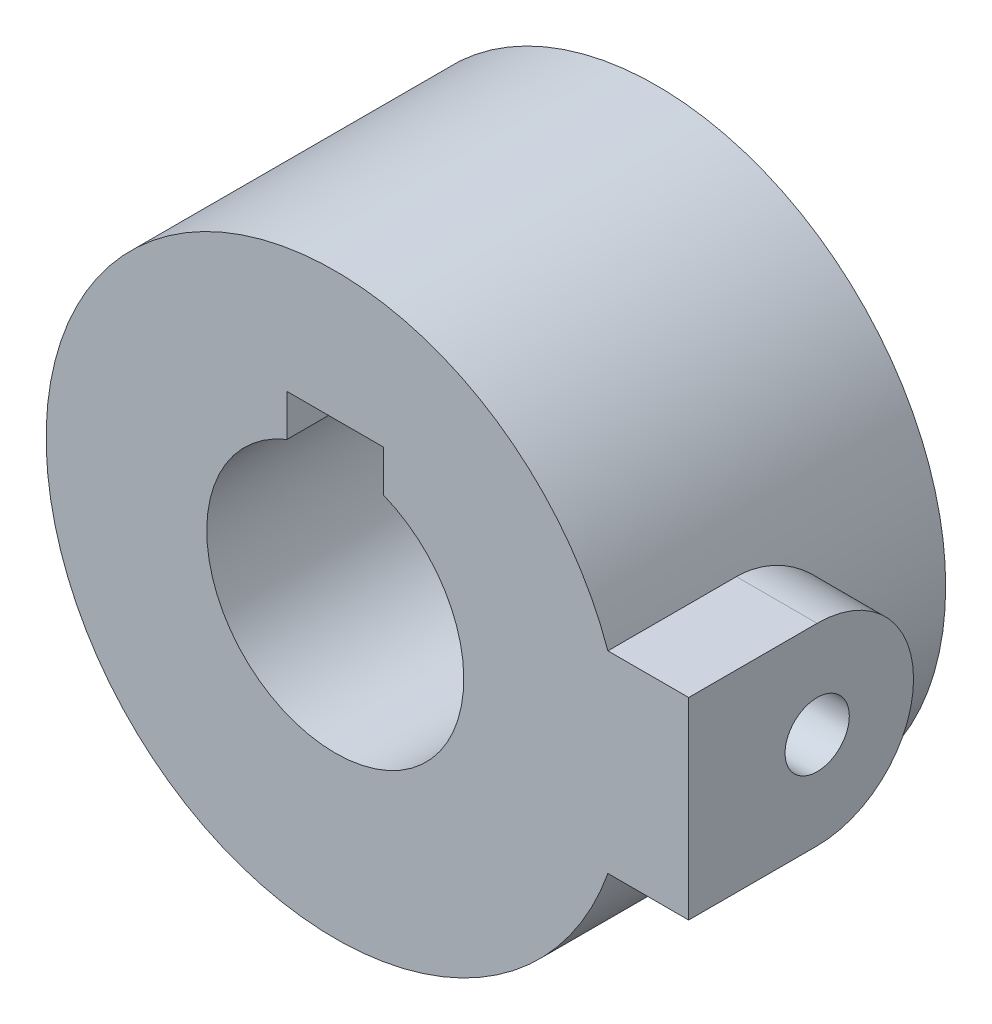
ISO-10303-21;
HEADER;
FILE_DESCRIPTION(('STEP AP214'),'2;1');
FILE_NAME('part.step','',(''),(''),'','','');
FILE_SCHEMA(('AUTOMOTIVE_DESIGN { 1 0 10303 214 1 1 1 1 }'));
ENDSEC;
DATA;
#1=APPLICATION_CONTEXT('core data for automotive mechanical design processes');
#2=APPLICATION_PROTOCOL_DEFINITION('international standard','automotive_design',2000,#1);
#3=PRODUCT_CONTEXT('',#1,'mechanical');
#4=PRODUCT('Part','Part','',(#3));
#5=PRODUCT_RELATED_PRODUCT_CATEGORY('part','',(#4));
#6=PRODUCT_DEFINITION_FORMATION('','',#4);
#7=PRODUCT_DEFINITION_CONTEXT('part definition',#1,'design');
#8=PRODUCT_DEFINITION('design','',#6,#7);
#9=PRODUCT_DEFINITION_SHAPE('','',#8);
#10=(LENGTH_UNIT() NAMED_UNIT(*) SI_UNIT(.MILLI.,.METRE.));
#11=(NAMED_UNIT(*) PLANE_ANGLE_UNIT() SI_UNIT($,.RADIAN.));
#12=(NAMED_UNIT(*) SI_UNIT($,.STERADIAN.) SOLID_ANGLE_UNIT());
#13=UNCERTAINTY_MEASURE_WITH_UNIT(LENGTH_MEASURE(1.E-05),#10,'distance_accuracy_value','');
#14=(GEOMETRIC_REPRESENTATION_CONTEXT(3) GLOBAL_UNCERTAINTY_ASSIGNED_CONTEXT((#13)) GLOBAL_UNIT_ASSIGNED_CONTEXT((#10,
#11,#12)) REPRESENTATION_CONTEXT('',''));
#15=CARTESIAN_POINT('',(0.,0.,0.));
#16=DIRECTION('',(0.,0.,1.));
#17=DIRECTION('',(1.,0.,0.));
#18=AXIS2_PLACEMENT_3D('',#15,#16,#17);
#19=CARTESIAN_POINT('',(0.,0.,20.));
#20=DIRECTION('',(0.,0.,1.));
#21=DIRECTION('',(1.,0.,0.));
#22=AXIS2_PLACEMENT_3D('',#19,#20,#21);
#23=PLANE('',#22);
#24=CARTESIAN_POINT('',(0.,0.,20.));
#25=DIRECTION('',(0.,0.,1.));
#26=DIRECTION('',(1.,0.,0.));
#27=AXIS2_PLACEMENT_3D('',#24,#25,#26);
#28=CIRCLE('',#27,18.);
#29=CARTESIAN_POINT('',(16.9705627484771,6.,20.));
#30=VERTEX_POINT('',#29);
#31=CARTESIAN_POINT('',(16.9705627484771,-6.,20.));
#32=VERTEX_POINT('',#31);
#33=EDGE_CURVE('E58',#30,#32,#28,.T.);
#34=ORIENTED_EDGE('',*,*,#33,.T.);
#35=DIRECTION('',(1.,0.,0.));
#36=VECTOR('',#35,1.);
#37=CARTESIAN_POINT('',(-500000.,-6.,20.));
#38=LINE('',#37,#36);
#39=CARTESIAN_POINT('',(22.,-6.,20.));
#40=VERTEX_POINT('',#39);
#41=EDGE_CURVE('E65',#32,#40,#38,.T.);
#42=ORIENTED_EDGE('',*,*,#41,.T.);
#43=DIRECTION('',(0.,-1.,0.));
#44=VECTOR('',#43,1.);
#45=CARTESIAN_POINT('',(22.,6.,20.));
#46=LINE('',#45,#44);
#47=CARTESIAN_POINT('',(22.,6.,20.));
#48=VERTEX_POINT('',#47);
#49=EDGE_CURVE('E132',#48,#40,#46,.T.);
#50=ORIENTED_EDGE('',*,*,#49,.F.);
#51=DIRECTION('',(1.,0.,0.));
#52=VECTOR('',#51,1.);
#53=CARTESIAN_POINT('',(-500000.,6.,20.));
#54=LINE('',#53,#52);
#55=EDGE_CURVE('E119',#30,#48,#54,.T.);
#56=ORIENTED_EDGE('',*,*,#55,.F.);
#57=EDGE_LOOP('',(#34,#42,#50,#56));
#58=FACE_BOUND('',#57,.T.);
#59=DIRECTION('',(0.,1.,0.));
#60=VECTOR('',#59,1.);
#61=CARTESIAN_POINT('',(3.,7.41619848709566,20.));
#62=LINE('',#61,#60);
#63=CARTESIAN_POINT('',(3.,7.41619848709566,20.));
#64=VERTEX_POINT('',#63);
#65=CARTESIAN_POINT('',(3.,10.,20.));
#66=VERTEX_POINT('',#65);
#67=EDGE_CURVE('E167',#64,#66,#62,.T.);
#68=ORIENTED_EDGE('',*,*,#67,.F.);
#69=CARTESIAN_POINT('',(0.,0.,20.));
#70=DIRECTION('',(0.,0.,1.));
#71=DIRECTION('',(1.,0.,0.));
#72=AXIS2_PLACEMENT_3D('',#69,#70,#71);
#73=CIRCLE('',#72,8.);
#74=CARTESIAN_POINT('',(-3.,7.41619848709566,20.));
#75=VERTEX_POINT('',#74);
#76=EDGE_CURVE('E153',#75,#64,#73,.T.);
#77=ORIENTED_EDGE('',*,*,#76,.F.);
#78=DIRECTION('',(0.,-1.,0.));
#79=VECTOR('',#78,1.);
#80=CARTESIAN_POINT('',(-3.,7.41619848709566,20.));
#81=LINE('',#80,#79);
#82=CARTESIAN_POINT('',(-3.,10.,20.));
#83=VERTEX_POINT('',#82);
#84=EDGE_CURVE('E149',#83,#75,#81,.T.);
#85=ORIENTED_EDGE('',*,*,#84,.F.);
#86=DIRECTION('',(-1.,0.,0.));
#87=VECTOR('',#86,1.);
#88=CARTESIAN_POINT('',(-3.,10.,20.));
#89=LINE('',#88,#87);
#90=EDGE_CURVE('E165',#66,#83,#89,.T.);
#91=ORIENTED_EDGE('',*,*,#90,.F.);
#92=EDGE_LOOP('',(#68,#77,#85,#91));
#93=FACE_BOUND('',#92,.T.);
#94=ADVANCED_FACE('F46',(#58,#93),#23,.T.);
#95=CARTESIAN_POINT('',(0.,0.,0.));
#96=DIRECTION('',(0.,0.,1.));
#97=DIRECTION('',(1.,0.,0.));
#98=AXIS2_PLACEMENT_3D('',#95,#96,#97);
#99=PLANE('',#98);
#100=CARTESIAN_POINT('',(0.,0.,0.));
#101=DIRECTION('',(0.,0.,1.));
#102=DIRECTION('',(1.,0.,0.));
#103=AXIS2_PLACEMENT_3D('',#100,#101,#102);
#104=CIRCLE('',#103,18.);
#105=CARTESIAN_POINT('',(18.,0.,0.));
#106=VERTEX_POINT('',#105);
#107=EDGE_CURVE('E136',#106,#106,#104,.T.);
#108=ORIENTED_EDGE('',*,*,#107,.F.);
#109=EDGE_LOOP('',(#108));
#110=FACE_BOUND('',#109,.T.);
#111=CARTESIAN_POINT('',(0.,0.,0.));
#112=DIRECTION('',(0.,0.,1.));
#113=DIRECTION('',(1.,0.,0.));
#114=AXIS2_PLACEMENT_3D('',#111,#112,#113);
#115=CIRCLE('',#114,8.);
#116=CARTESIAN_POINT('',(-3.,7.41619848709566,0.));
#117=VERTEX_POINT('',#116);
#118=CARTESIAN_POINT('',(3.,7.41619848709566,0.));
#119=VERTEX_POINT('',#118);
#120=EDGE_CURVE('E160',#117,#119,#115,.T.);
#121=ORIENTED_EDGE('',*,*,#120,.T.);
#122=DIRECTION('',(0.,1.,0.));
#123=VECTOR('',#122,1.);
#124=CARTESIAN_POINT('',(3.,7.41619848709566,0.));
#125=LINE('',#124,#123);
#126=CARTESIAN_POINT('',(3.,10.,0.));
#127=VERTEX_POINT('',#126);
#128=EDGE_CURVE('E157',#119,#127,#125,.T.);
#129=ORIENTED_EDGE('',*,*,#128,.T.);
#130=DIRECTION('',(-1.,0.,0.));
#131=VECTOR('',#130,1.);
#132=CARTESIAN_POINT('',(-3.,10.,0.));
#133=LINE('',#132,#131);
#134=CARTESIAN_POINT('',(-3.,10.,0.));
#135=VERTEX_POINT('',#134);
#136=EDGE_CURVE('E154',#127,#135,#133,.T.);
#137=ORIENTED_EDGE('',*,*,#136,.T.);
#138=DIRECTION('',(0.,-1.,0.));
#139=VECTOR('',#138,1.);
#140=CARTESIAN_POINT('',(-3.,7.41619848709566,0.));
#141=LINE('',#140,#139);
#142=EDGE_CURVE('E150',#135,#117,#141,.T.);
#143=ORIENTED_EDGE('',*,*,#142,.T.);
#144=EDGE_LOOP('',(#121,#129,#137,#143));
#145=FACE_BOUND('',#144,.T.);
#146=ADVANCED_FACE('F212',(#110,#145),#99,.F.);
#147=CARTESIAN_POINT('',(0.,0.,20.));
#148=DIRECTION('',(0.,0.,-1.));
#149=DIRECTION('',(-1.,0.,0.));
#150=AXIS2_PLACEMENT_3D('',#147,#148,#149);
#151=CYLINDRICAL_SURFACE('',#150,18.);
#152=ORIENTED_EDGE('',*,*,#33,.F.);
#153=DIRECTION('',(0.,0.,-1.));
#154=VECTOR('',#153,1.);
#155=CARTESIAN_POINT('',(16.9705627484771,6.,20.));
#156=LINE('',#155,#154);
#157=CARTESIAN_POINT('',(16.9705627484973,6.,12.));
#158=VERTEX_POINT('',#157);
#159=EDGE_CURVE('E115',#158,#30,#156,.F.);
#160=ORIENTED_EDGE('',*,*,#159,.F.);
#161=CARTESIAN_POINT('',(16.9705627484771,-6.,12.));
#162=CARTESIAN_POINT('',(16.9705358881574,-6.00002327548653,11.8363059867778));
#163=CARTESIAN_POINT('',(16.9729302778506,-5.99330214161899,11.6726221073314));
#164=CARTESIAN_POINT('',(16.9823649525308,-5.96654425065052,11.3465240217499));
#165=CARTESIAN_POINT('',(16.9894039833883,-5.94651108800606,11.1841094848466));
#166=CARTESIAN_POINT('',(17.0079041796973,-5.89338071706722,10.8621857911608));
#167=CARTESIAN_POINT('',(17.0193522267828,-5.86032225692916,10.7026694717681));
#168=CARTESIAN_POINT('',(17.0463054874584,-5.78145443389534,10.3871697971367));
#169=CARTESIAN_POINT('',(17.0618108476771,-5.73564461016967,10.231186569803));
#170=CARTESIAN_POINT('',(17.096396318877,-5.63171582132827,9.92393152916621));
#171=CARTESIAN_POINT('',(17.1154735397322,-5.57360680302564,9.77265602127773));
#172=CARTESIAN_POINT('',(17.1566605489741,-5.44550500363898,9.47558904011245));
#173=CARTESIAN_POINT('',(17.1787714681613,-5.37550778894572,9.32979963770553));
#174=CARTESIAN_POINT('',(17.2254031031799,-5.22415126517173,9.04461346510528));
#175=CARTESIAN_POINT('',(17.2499242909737,-5.14278972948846,8.90521795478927));
#176=CARTESIAN_POINT('',(17.3007173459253,-4.9692408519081,8.63360277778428));
#177=CARTESIAN_POINT('',(17.326989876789,-4.8770493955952,8.50138586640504));
#178=CARTESIAN_POINT('',(17.3815260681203,-4.67904463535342,8.24043953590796));
#179=CARTESIAN_POINT('',(17.4098272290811,-4.57286774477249,8.11199371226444));
#180=CARTESIAN_POINT('',(17.4667935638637,-4.35021031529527,7.86437382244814));
#181=CARTESIAN_POINT('',(17.49545886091,-4.23372620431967,7.74520299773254));
#182=CARTESIAN_POINT('',(17.5523750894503,-3.99119540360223,7.51691026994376));
#183=CARTESIAN_POINT('',(17.5806260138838,-3.86514855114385,7.40778853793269));
#184=CARTESIAN_POINT('',(17.6359611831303,-3.60425478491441,7.20029931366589));
#185=CARTESIAN_POINT('',(17.6630454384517,-3.46940795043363,7.1019317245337));
#186=CARTESIAN_POINT('',(17.716017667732,-3.1880620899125,6.91417565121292));
#187=CARTESIAN_POINT('',(17.7418552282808,-3.04134950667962,6.82509253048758));
#188=CARTESIAN_POINT('',(17.790803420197,-2.74053335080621,6.65968846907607));
#189=CARTESIAN_POINT('',(17.8139150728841,-2.5864325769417,6.58336274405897));
#190=CARTESIAN_POINT('',(17.8567641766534,-2.27182245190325,6.44406426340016));
#191=CARTESIAN_POINT('',(17.8765010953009,-2.11131209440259,6.38109361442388));
#192=CARTESIAN_POINT('',(17.9120119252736,-1.78513959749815,6.26911941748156));
#193=CARTESIAN_POINT('',(17.9277876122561,-1.61947980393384,6.22010961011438));
#194=CARTESIAN_POINT('',(17.9544516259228,-1.28997729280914,6.13793631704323));
#195=CARTESIAN_POINT('',(17.9654893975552,-1.12626807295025,6.10428575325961));
#196=CARTESIAN_POINT('',(17.9831292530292,-0.796442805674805,6.05074979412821));
#197=CARTESIAN_POINT('',(17.9897331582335,-0.630327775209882,6.03085874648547));
#198=CARTESIAN_POINT('',(17.9983239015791,-0.296898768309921,6.00501776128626));
#199=CARTESIAN_POINT('',(18.0003107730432,-0.129584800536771,5.99906772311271));
#200=CARTESIAN_POINT('',(17.999610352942,0.204943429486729,6.00116890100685));
#201=CARTESIAN_POINT('',(17.9969231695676,0.372157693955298,6.00921979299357));
#202=CARTESIAN_POINT('',(17.987149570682,0.698613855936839,6.038646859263));
#203=CARTESIAN_POINT('',(17.9802409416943,0.857909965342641,6.05948465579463));
#204=CARTESIAN_POINT('',(17.9623622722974,1.17415159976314,6.1138198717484));
#205=CARTESIAN_POINT('',(17.9513908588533,1.33109631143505,6.14732157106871));
#206=CARTESIAN_POINT('',(17.9256761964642,1.64145470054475,6.22667565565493));
#207=CARTESIAN_POINT('',(17.9109342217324,1.79486955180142,6.27252386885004));
#208=CARTESIAN_POINT('',(17.8780472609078,2.09727695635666,6.37621207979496));
#209=CARTESIAN_POINT('',(17.8599009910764,2.24626781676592,6.4340566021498));
#210=CARTESIAN_POINT('',(17.8204139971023,2.54070679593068,6.56208597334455));
#211=CARTESIAN_POINT('',(17.7990354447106,2.686085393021,6.632418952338));
#212=CARTESIAN_POINT('',(17.753792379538,2.97045362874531,6.78440731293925));
#213=CARTESIAN_POINT('',(17.7299270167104,3.10944105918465,6.86606656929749));
#214=CARTESIAN_POINT('',(17.6803107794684,3.38017058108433,7.04012638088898));
#215=CARTESIAN_POINT('',(17.6545598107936,3.51191230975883,7.13252747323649));
#216=CARTESIAN_POINT('',(17.601809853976,3.767400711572,7.32747242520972));
#217=CARTESIAN_POINT('',(17.5748108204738,3.89114709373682,7.43001665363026));
#218=CARTESIAN_POINT('',(17.5189422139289,4.13559143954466,7.64969602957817));
#219=CARTESIAN_POINT('',(17.4900445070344,4.2558696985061,7.76729146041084));
#220=CARTESIAN_POINT('',(17.4324086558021,4.4861132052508,8.01214074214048));
#221=CARTESIAN_POINT('',(17.4036704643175,4.59608167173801,8.13939155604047));
#222=CARTESIAN_POINT('',(17.3471202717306,4.8051173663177,8.40289722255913));
#223=CARTESIAN_POINT('',(17.3193089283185,4.90417696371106,8.53915827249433));
#224=CARTESIAN_POINT('',(17.2654357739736,5.09059336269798,8.81971485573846));
#225=CARTESIAN_POINT('',(17.239373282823,5.17795472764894,8.96400722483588));
#226=CARTESIAN_POINT('',(17.1893738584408,5.34161618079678,9.26203101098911));
#227=CARTESIAN_POINT('',(17.1654753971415,5.41772728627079,9.41587280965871));
#228=CARTESIAN_POINT('',(17.1210224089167,5.556609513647,9.72985774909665));
#229=CARTESIAN_POINT('',(17.1004664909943,5.61938618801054,9.88999823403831));
#230=CARTESIAN_POINT('',(17.0633817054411,5.73100924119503,10.2153228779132));
#231=CARTESIAN_POINT('',(17.0468484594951,5.77987077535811,10.3805013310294));
#232=CARTESIAN_POINT('',(17.0183470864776,5.86325820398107,10.7147529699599));
#233=CARTESIAN_POINT('',(17.0063768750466,5.89779064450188,10.883824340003));
#234=CARTESIAN_POINT('',(16.9882040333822,5.94992929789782,11.2104634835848));
#235=CARTESIAN_POINT('',(16.9816058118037,5.96870055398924,11.3678241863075));
#236=CARTESIAN_POINT('',(16.9727764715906,5.99373749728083,11.6834525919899));
#237=CARTESIAN_POINT('',(16.9705397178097,6.00001932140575,11.8417188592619));
#238=CARTESIAN_POINT('',(16.9705627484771,6.,12.));
#239=B_SPLINE_CURVE_WITH_KNOTS('',3,(#161,#162,#163,#164,#165,#166,#167,#168,#169,#170,#171,
#172,#173,#174,#175,#176,#177,#178,#179,#180,#181,#182,#183,#184,#185,#186,#187,#188,#189,#190,
#191,#192,#193,#194,#195,#196,#197,#198,#199,#200,#201,#202,#203,#204,#205,#206,#207,#208,#209,
#210,#211,#212,#213,#214,#215,#216,#217,#218,#219,#220,#221,#222,#223,#224,#225,#226,#227,#228,
#229,#230,#231,#232,#233,#234,#235,#236,#237,#238),.UNSPECIFIED.,.F.,.F.,(4,2,2,2,2,2,2,2,2,2,2,
2,2,2,2,2,2,2,2,2,2,2,2,2,2,2,2,2,2,2,2,2,2,2,2,2,2,2,4),(0.,0.490910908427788,0.9816893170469,
1.47101863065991,1.96036563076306,2.44931837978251,2.93845388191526,3.42768535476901,
3.91710329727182,4.42363425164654,4.93034144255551,5.43705725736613,5.94376850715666,
6.46384823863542,6.98373248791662,7.50369868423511,8.02343138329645,8.52528690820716,
9.02693615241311,9.52858177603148,10.0302157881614,10.5120543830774,10.9940559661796,
11.4758948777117,11.9579158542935,12.4460912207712,12.9344340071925,13.4228012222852,
13.9111862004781,14.4226273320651,14.9339082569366,15.445544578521,15.9569807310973,
16.4762155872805,16.9952338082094,17.5136845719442,18.0318982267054,18.5071898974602,
18.9818670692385),.UNSPECIFIED.);
#240=CARTESIAN_POINT('',(16.9705627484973,-6.,12.));
#241=VERTEX_POINT('',#240);
#242=EDGE_CURVE('E126',#241,#158,#239,.T.);
#243=ORIENTED_EDGE('',*,*,#242,.F.);
#244=DIRECTION('',(0.,0.,-1.));
#245=VECTOR('',#244,1.);
#246=CARTESIAN_POINT('',(16.9705627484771,-6.,20.));
#247=LINE('',#246,#245);
#248=EDGE_CURVE('E125',#32,#241,#247,.T.);
#249=ORIENTED_EDGE('',*,*,#248,.F.);
#250=EDGE_LOOP('',(#152,#160,#243,#249));
#251=FACE_BOUND('',#250,.T.);
#252=ORIENTED_EDGE('',*,*,#107,.T.);
#253=EDGE_LOOP('',(#252));
#254=FACE_BOUND('',#253,.T.);
#255=ADVANCED_FACE('F48',(#251,#254),#151,.T.);
#256=CARTESIAN_POINT('',(0.,0.,20.));
#257=DIRECTION('',(0.,0.,-1.));
#258=DIRECTION('',(-1.,0.,0.));
#259=AXIS2_PLACEMENT_3D('',#256,#257,#258);
#260=CYLINDRICAL_SURFACE('',#259,8.);
#261=ORIENTED_EDGE('',*,*,#120,.F.);
#262=DIRECTION('',(0.,0.,-1.));
#263=VECTOR('',#262,1.);
#264=CARTESIAN_POINT('',(-3.,7.41619848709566,20.));
#265=LINE('',#264,#263);
#266=EDGE_CURVE('E146',#75,#117,#265,.T.);
#267=ORIENTED_EDGE('',*,*,#266,.F.);
#268=ORIENTED_EDGE('',*,*,#76,.T.);
#269=DIRECTION('',(0.,0.,-1.));
#270=VECTOR('',#269,1.);
#271=CARTESIAN_POINT('',(3.,7.41619848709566,20.));
#272=LINE('',#271,#270);
#273=EDGE_CURVE('E139',#64,#119,#272,.T.);
#274=ORIENTED_EDGE('',*,*,#273,.T.);
#275=EDGE_LOOP('',(#261,#267,#268,#274));
#276=FACE_BOUND('',#275,.T.);
#277=ADVANCED_FACE('F219',(#276),#260,.F.);
#278=CARTESIAN_POINT('',(3.,7.41619848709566,20.));
#279=DIRECTION('',(-1.,0.,0.));
#280=DIRECTION('',(0.,0.,1.));
#281=AXIS2_PLACEMENT_3D('',#278,#279,#280);
#282=PLANE('',#281);
#283=ORIENTED_EDGE('',*,*,#128,.F.);
#284=ORIENTED_EDGE('',*,*,#273,.F.);
#285=ORIENTED_EDGE('',*,*,#67,.T.);
#286=DIRECTION('',(0.,0.,-1.));
#287=VECTOR('',#286,1.);
#288=CARTESIAN_POINT('',(3.,10.,20.));
#289=LINE('',#288,#287);
#290=EDGE_CURVE('E143',#66,#127,#289,.T.);
#291=ORIENTED_EDGE('',*,*,#290,.T.);
#292=EDGE_LOOP('',(#283,#284,#285,#291));
#293=FACE_BOUND('',#292,.T.);
#294=ADVANCED_FACE('F222',(#293),#282,.T.);
#295=CARTESIAN_POINT('',(-3.,10.,20.));
#296=DIRECTION('',(0.,-1.,0.));
#297=DIRECTION('',(0.,0.,-1.));
#298=AXIS2_PLACEMENT_3D('',#295,#296,#297);
#299=PLANE('',#298);
#300=ORIENTED_EDGE('',*,*,#136,.F.);
#301=ORIENTED_EDGE('',*,*,#290,.F.);
#302=ORIENTED_EDGE('',*,*,#90,.T.);
#303=DIRECTION('',(0.,0.,-1.));
#304=VECTOR('',#303,1.);
#305=CARTESIAN_POINT('',(-3.,10.,20.));
#306=LINE('',#305,#304);
#307=EDGE_CURVE('E73',#83,#135,#306,.T.);
#308=ORIENTED_EDGE('',*,*,#307,.T.);
#309=EDGE_LOOP('',(#300,#301,#302,#308));
#310=FACE_BOUND('',#309,.T.);
#311=ADVANCED_FACE('F206',(#310),#299,.T.);
#312=CARTESIAN_POINT('',(-3.,7.41619848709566,20.));
#313=DIRECTION('',(1.,0.,0.));
#314=DIRECTION('',(0.,1.,0.));
#315=AXIS2_PLACEMENT_3D('',#312,#313,#314);
#316=PLANE('',#315);
#317=ORIENTED_EDGE('',*,*,#142,.F.);
#318=ORIENTED_EDGE('',*,*,#307,.F.);
#319=ORIENTED_EDGE('',*,*,#84,.T.);
#320=ORIENTED_EDGE('',*,*,#266,.T.);
#321=EDGE_LOOP('',(#317,#318,#319,#320));
#322=FACE_BOUND('',#321,.T.);
#323=ADVANCED_FACE('F199',(#322),#316,.T.);
#324=CARTESIAN_POINT('',(-500000.,6.,12.));
#325=DIRECTION('',(0.,1.,0.));
#326=DIRECTION('',(0.,0.,1.));
#327=AXIS2_PLACEMENT_3D('',#324,#325,#326);
#328=PLANE('',#327);
#329=DIRECTION('',(1.,0.,0.));
#330=VECTOR('',#329,1.);
#331=CARTESIAN_POINT('',(-500000.,6.,12.));
#332=LINE('',#331,#330);
#333=CARTESIAN_POINT('',(22.,6.,12.));
#334=VERTEX_POINT('',#333);
#335=EDGE_CURVE('E121',#158,#334,#332,.T.);
#336=ORIENTED_EDGE('',*,*,#335,.F.);
#337=ORIENTED_EDGE('',*,*,#159,.T.);
#338=ORIENTED_EDGE('',*,*,#55,.T.);
#339=DIRECTION('',(0.,0.,1.));
#340=VECTOR('',#339,1.);
#341=CARTESIAN_POINT('',(22.,6.,12.));
#342=LINE('',#341,#340);
#343=EDGE_CURVE('E179',#334,#48,#342,.T.);
#344=ORIENTED_EDGE('',*,*,#343,.F.);
#345=EDGE_LOOP('',(#336,#337,#338,#344));
#346=FACE_BOUND('',#345,.T.);
#347=ADVANCED_FACE('F117',(#346),#328,.T.);
#348=CARTESIAN_POINT('',(22.,0.,12.));
#349=DIRECTION('',(1.,0.,0.));
#350=DIRECTION('',(0.,0.,-1.));
#351=AXIS2_PLACEMENT_3D('',#348,#349,#350);
#352=PLANE('',#351);
#353=CARTESIAN_POINT('',(22.,0.,12.));
#354=DIRECTION('',(1.,0.,0.));
#355=DIRECTION('',(0.,0.,-1.));
#356=AXIS2_PLACEMENT_3D('',#353,#354,#355);
#357=CIRCLE('',#356,2.);
#358=CARTESIAN_POINT('',(22.,0.,10.));
#359=VERTEX_POINT('',#358);
#360=EDGE_CURVE('E174',#359,#359,#357,.T.);
#361=ORIENTED_EDGE('',*,*,#360,.F.);
#362=EDGE_LOOP('',(#361));
#363=FACE_BOUND('',#362,.T.);
#364=CARTESIAN_POINT('',(22.,0.,12.));
#365=DIRECTION('',(1.,0.,0.));
#366=DIRECTION('',(0.,0.,-1.));
#367=AXIS2_PLACEMENT_3D('',#364,#365,#366);
#368=CIRCLE('',#367,6.);
#369=CARTESIAN_POINT('',(22.,-6.,12.));
#370=VERTEX_POINT('',#369);
#371=EDGE_CURVE('E163',#370,#334,#368,.T.);
#372=ORIENTED_EDGE('',*,*,#371,.T.);
#373=ORIENTED_EDGE('',*,*,#343,.T.);
#374=ORIENTED_EDGE('',*,*,#49,.T.);
#375=DIRECTION('',(0.,0.,-1.));
#376=VECTOR('',#375,1.);
#377=CARTESIAN_POINT('',(22.,-6.,12.));
#378=LINE('',#377,#376);
#379=EDGE_CURVE('E177',#40,#370,#378,.T.);
#380=ORIENTED_EDGE('',*,*,#379,.T.);
#381=EDGE_LOOP('',(#372,#373,#374,#380));
#382=FACE_BOUND('',#381,.T.);
#383=ADVANCED_FACE('F197',(#363,#382),#352,.T.);
#384=CARTESIAN_POINT('',(-500000.,0.,12.));
#385=DIRECTION('',(1.,0.,0.));
#386=DIRECTION('',(0.,0.,-1.));
#387=AXIS2_PLACEMENT_3D('',#384,#385,#386);
#388=CYLINDRICAL_SURFACE('',#387,6.);
#389=DIRECTION('',(1.,0.,0.));
#390=VECTOR('',#389,1.);
#391=CARTESIAN_POINT('',(-500000.,-6.,12.));
#392=LINE('',#391,#390);
#393=EDGE_CURVE('E172',#241,#370,#392,.T.);
#394=ORIENTED_EDGE('',*,*,#393,.F.);
#395=ORIENTED_EDGE('',*,*,#242,.T.);
#396=ORIENTED_EDGE('',*,*,#335,.T.);
#397=ORIENTED_EDGE('',*,*,#371,.F.);
#398=EDGE_LOOP('',(#394,#395,#396,#397));
#399=FACE_BOUND('',#398,.T.);
#400=ADVANCED_FACE('F191',(#399),#388,.T.);
#401=CARTESIAN_POINT('',(-500000.,-6.,12.));
#402=DIRECTION('',(0.,-1.,0.));
#403=DIRECTION('',(0.,0.,-1.));
#404=AXIS2_PLACEMENT_3D('',#401,#402,#403);
#405=PLANE('',#404);
#406=ORIENTED_EDGE('',*,*,#41,.F.);
#407=ORIENTED_EDGE('',*,*,#248,.T.);
#408=ORIENTED_EDGE('',*,*,#393,.T.);
#409=ORIENTED_EDGE('',*,*,#379,.F.);
#410=EDGE_LOOP('',(#406,#407,#408,#409));
#411=FACE_BOUND('',#410,.T.);
#412=ADVANCED_FACE('F231',(#411),#405,.T.);
#413=CARTESIAN_POINT('',(-500000.,0.,12.));
#414=DIRECTION('',(1.,0.,0.));
#415=DIRECTION('',(0.,0.,-1.));
#416=AXIS2_PLACEMENT_3D('',#413,#414,#415);
#417=CYLINDRICAL_SURFACE('',#416,2.);
#418=ORIENTED_EDGE('',*,*,#360,.T.);
#419=EDGE_LOOP('',(#418));
#420=FACE_BOUND('',#419,.T.);
#421=CARTESIAN_POINT('',(18.,0.,10.));
#422=CARTESIAN_POINT('',(17.9999985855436,-0.111970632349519,10.0000048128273));
#423=CARTESIAN_POINT('',(17.9989441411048,-0.22401360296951,10.0094347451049));
#424=CARTESIAN_POINT('',(17.9948391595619,-0.444988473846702,10.0469075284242));
#425=CARTESIAN_POINT('',(17.9917864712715,-0.553916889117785,10.0749704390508));
#426=CARTESIAN_POINT('',(17.9840293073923,-0.76543107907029,10.1488779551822));
#427=CARTESIAN_POINT('',(17.9793258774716,-0.868020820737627,10.1947113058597));
#428=CARTESIAN_POINT('',(17.9687919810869,-1.06403053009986,10.3028356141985));
#429=CARTESIAN_POINT('',(17.9629617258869,-1.1574522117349,10.3651234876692));
#430=CARTESIAN_POINT('',(17.9507977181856,-1.33290575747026,10.5046820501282));
#431=CARTESIAN_POINT('',(17.9444620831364,-1.4148915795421,10.5820104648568));
#432=CARTESIAN_POINT('',(17.9320167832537,-1.5647500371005,10.7493314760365));
#433=CARTESIAN_POINT('',(17.9259071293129,-1.63262199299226,10.8393246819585));
#434=CARTESIAN_POINT('',(17.9145866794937,-1.7524930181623,11.0297139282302));
#435=CARTESIAN_POINT('',(17.9093782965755,-1.80444975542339,11.1301367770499));
#436=CARTESIAN_POINT('',(17.9004741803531,-1.89074517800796,11.3383494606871));
#437=CARTESIAN_POINT('',(17.8967784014,-1.92508439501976,11.446139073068));
#438=CARTESIAN_POINT('',(17.8913354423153,-1.97503194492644,11.6655519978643));
#439=CARTESIAN_POINT('',(17.8895802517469,-1.99071729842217,11.7771575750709));
#440=CARTESIAN_POINT('',(17.8881925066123,-2.00315006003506,12.0014298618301));
#441=CARTESIAN_POINT('',(17.8885598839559,-1.99989807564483,12.1140965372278));
#442=CARTESIAN_POINT('',(17.891368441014,-1.97461184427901,12.3367594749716));
#443=CARTESIAN_POINT('',(17.8938003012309,-1.95266200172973,12.4467654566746));
#444=CARTESIAN_POINT('',(17.9004492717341,-1.89073461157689,12.6615226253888));
#445=CARTESIAN_POINT('',(17.904666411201,-1.85075676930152,12.7662737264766));
#446=CARTESIAN_POINT('',(17.9144214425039,-1.75381606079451,12.9678124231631));
#447=CARTESIAN_POINT('',(17.9199622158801,-1.6968160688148,13.0645820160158));
#448=CARTESIAN_POINT('',(17.9317378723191,-1.56747570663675,13.2472136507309));
#449=CARTESIAN_POINT('',(17.9379727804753,-1.49513478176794,13.3330752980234));
#450=CARTESIAN_POINT('',(17.9504756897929,-1.33669614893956,13.4919439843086));
#451=CARTESIAN_POINT('',(17.9567436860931,-1.25052560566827,13.5648784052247));
#452=CARTESIAN_POINT('',(17.9685745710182,-1.06712581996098,13.6952583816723));
#453=CARTESIAN_POINT('',(17.9741374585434,-0.969896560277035,13.7527039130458));
#454=CARTESIAN_POINT('',(17.9839338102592,-0.767086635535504,13.8504737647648));
#455=CARTESIAN_POINT('',(17.9881669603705,-0.661504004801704,13.8907940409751));
#456=CARTESIAN_POINT('',(17.9948238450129,-0.445009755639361,13.9531137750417));
#457=CARTESIAN_POINT('',(17.997247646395,-0.334098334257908,13.9751139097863));
#458=CARTESIAN_POINT('',(18.0000041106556,-0.110723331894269,14.0000759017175));
#459=CARTESIAN_POINT('',(18.0003477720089,0.00172892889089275,14.0031378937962));
#460=CARTESIAN_POINT('',(17.998934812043,0.225544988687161,13.9904002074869));
#461=CARTESIAN_POINT('',(17.9971782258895,0.33690880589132,13.9746008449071));
#462=CARTESIAN_POINT('',(17.9917690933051,0.555095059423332,13.9246720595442));
#463=CARTESIAN_POINT('',(17.9881214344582,0.661928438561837,13.8905898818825));
#464=CARTESIAN_POINT('',(17.9793390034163,0.868362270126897,13.8051117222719));
#465=CARTESIAN_POINT('',(17.9742041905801,0.967962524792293,13.753715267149));
#466=CARTESIAN_POINT('',(17.9629935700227,1.15755326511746,13.634821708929));
#467=CARTESIAN_POINT('',(17.9569139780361,1.24750253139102,13.5672592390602));
#468=CARTESIAN_POINT('',(17.9445071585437,1.41481983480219,13.4180447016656));
#469=CARTESIAN_POINT('',(17.938179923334,1.49218748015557,13.3363921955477));
#470=CARTESIAN_POINT('',(17.925957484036,1.63249622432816,13.1608767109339));
#471=CARTESIAN_POINT('',(17.920064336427,1.69537132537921,13.0669608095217));
#472=CARTESIAN_POINT('',(17.9094097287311,1.80445556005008,12.8698437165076));
#473=CARTESIAN_POINT('',(17.9046482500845,1.85066496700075,12.7666426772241));
#474=CARTESIAN_POINT('',(17.8968094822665,1.92499712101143,12.5541055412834));
#475=CARTESIAN_POINT('',(17.8937286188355,1.95315827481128,12.4447830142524));
#476=CARTESIAN_POINT('',(17.8895891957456,1.99071877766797,12.2229248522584));
#477=CARTESIAN_POINT('',(17.8885305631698,2.00011880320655,12.1103893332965));
#478=CARTESIAN_POINT('',(17.8885572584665,1.99987957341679,11.8859558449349));
#479=CARTESIAN_POINT('',(17.8896309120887,1.99034399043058,11.774057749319));
#480=CARTESIAN_POINT('',(17.8937762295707,1.9527225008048,11.5534642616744));
#481=CARTESIAN_POINT('',(17.8968478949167,1.92463658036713,11.4447688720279));
#482=CARTESIAN_POINT('',(17.9046397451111,1.85074191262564,11.2336724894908));
#483=CARTESIAN_POINT('',(17.9093595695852,1.80493703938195,11.1312701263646));
#484=CARTESIAN_POINT('',(17.9199166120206,1.69691508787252,10.9355895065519));
#485=CARTESIAN_POINT('',(17.9257538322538,1.63469797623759,10.842311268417));
#486=CARTESIAN_POINT('',(17.9379262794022,1.49522995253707,10.6669957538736));
#487=CARTESIAN_POINT('',(17.944263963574,1.41790170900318,10.5850201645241));
#488=CARTESIAN_POINT('',(17.9567010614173,1.25056419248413,10.4351661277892));
#489=CARTESIAN_POINT('',(17.962800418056,1.16055190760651,10.3672910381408));
#490=CARTESIAN_POINT('',(17.9740935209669,0.970094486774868,10.2473956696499));
#491=CARTESIAN_POINT('',(17.9792844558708,0.869618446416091,10.1954242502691));
#492=CARTESIAN_POINT('',(17.9881463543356,0.66136849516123,10.1091625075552));
#493=CARTESIAN_POINT('',(17.9918190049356,0.55360283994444,10.0748525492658));
#494=CARTESIAN_POINT('',(17.9963232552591,0.371040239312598,10.0333008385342));
#495=CARTESIAN_POINT('',(17.9976954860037,0.297404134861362,10.0208304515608));
#496=CARTESIAN_POINT('',(17.9995343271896,0.149189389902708,10.004178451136));
#497=CARTESIAN_POINT('',(18.000000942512,0.074610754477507,9.99999679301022));
#498=CARTESIAN_POINT('',(18.,0.,10.));
#499=B_SPLINE_CURVE_WITH_KNOTS('',3,(#421,#422,#423,#424,#425,#426,#427,#428,#429,#430,#431,
#432,#433,#434,#435,#436,#437,#438,#439,#440,#441,#442,#443,#444,#445,#446,#447,#448,#449,#450,
#451,#452,#453,#454,#455,#456,#457,#458,#459,#460,#461,#462,#463,#464,#465,#466,#467,#468,#469,
#470,#471,#472,#473,#474,#475,#476,#477,#478,#479,#480,#481,#482,#483,#484,#485,#486,#487,#488,
#489,#490,#491,#492,#493,#494,#495,#496,#497,#498),.UNSPECIFIED.,.T.,.F.,(4,2,2,2,2,2,2,2,2,2,2,
2,2,2,2,2,2,2,2,2,2,2,2,2,2,2,2,2,2,2,2,2,2,2,2,2,2,2,4),(0.,0.335639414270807,
0.671640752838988,1.00742963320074,1.34315561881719,1.68019649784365,2.01725360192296,
2.35519959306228,2.69313538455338,3.02967096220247,3.36619574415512,3.70120941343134,
4.03622855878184,4.37198379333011,4.70775116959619,5.0453487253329,5.3829468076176,
5.72062456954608,6.05828985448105,6.39416820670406,6.73004093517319,7.06504987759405,
7.40006797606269,7.73646430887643,8.07287111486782,8.41078088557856,8.74868511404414,
9.08586787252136,9.42303847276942,9.75836815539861,10.0936980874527,10.4289547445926,
10.7642120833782,11.1012322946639,11.4383326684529,11.7764585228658,12.1142076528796,
12.3378595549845,12.5615102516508),.UNSPECIFIED.);
#500=CARTESIAN_POINT('',(18.,0.,10.));
#501=VERTEX_POINT('',#500);
#502=EDGE_CURVE('E12',#501,#501,#499,.T.);
#503=ORIENTED_EDGE('',*,*,#502,.T.);
#504=EDGE_LOOP('',(#503));
#505=FACE_BOUND('',#504,.T.);
#506=ADVANCED_FACE('F208',(#420,#505),#417,.F.);
#507=ORIENTED_EDGE('',*,*,#502,.F.);
#508=EDGE_LOOP('',(#507));
#509=FACE_BOUND('',#508,.T.);
#510=ADVANCED_FACE('F200',(#509),#151,.T.);
#511=CLOSED_SHELL('',(#94,#146,#255,#277,#294,#311,#323,#347,#383,#400,#412,#506,#510));
#512=MANIFOLD_SOLID_BREP('B2',#511);
#513=ADVANCED_BREP_SHAPE_REPRESENTATION('',(#18,#512),#14);
#514=SHAPE_DEFINITION_REPRESENTATION(#9,#513);
ENDSEC;
END-ISO-10303-21;
